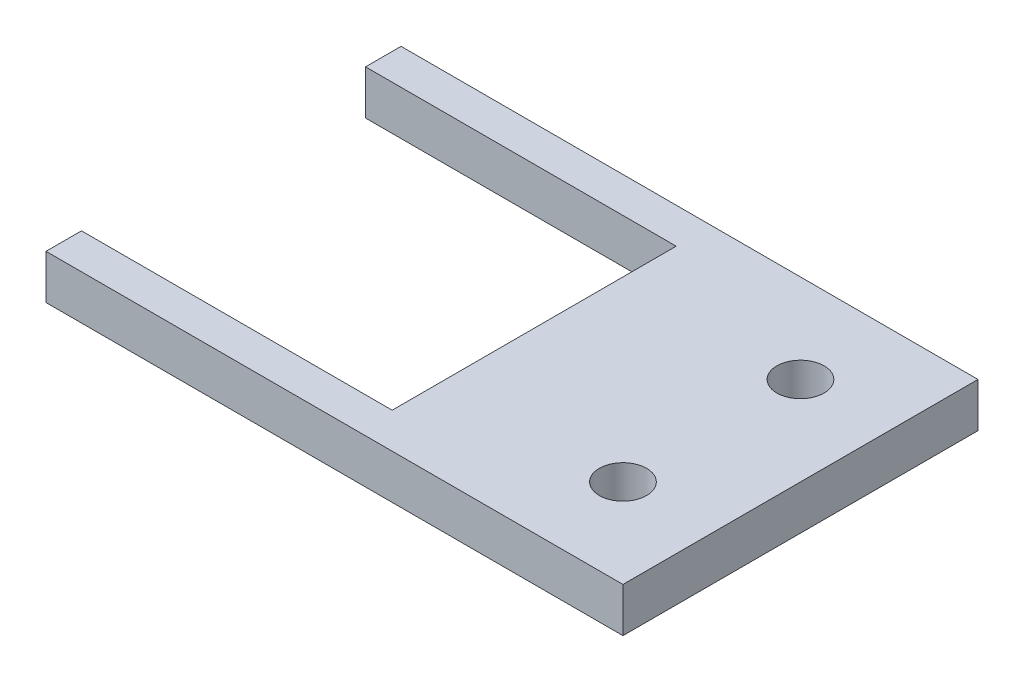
from build123d import *

# Parameters (mm, degrees)
SKETCH1_W                = 76.2
SKETCH1_H                = 50.8
BOSS_EXTRUDE1_DEPTH      = 6.35
SKETCH2_W                = 44.45
SKETCH2_H                = 35.56
CUT_EXTRUDE1_DEPTH       = 6.35
SKETCH5_W                = 44.45
SKETCH5_H                = 2.54
CUT_EXTRUDE3_DEPTH       = 55.417029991
CUT_EXTRUDE5_DEPTH       = 55.417029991
CUT_EXTRUDE5_DEPTH_BACK  = 55.417029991
SKETCH6_W                = 44.45
SKETCH6_H                = 2.54
SKETCH7_W                = 50.8
SKETCH7_H                = 6.35
BOSS_EXTRUDE2_DEPTH      = 6.35
H_0_266_DIAMETER_HOLE1_D = 6.7564


with BuildPart() as part:
    # Sketch1 → Boss-Extrude1 (new body)
    with BuildSketch(Plane(origin=(0, 0, 0), x_dir=(1, 0, 0), z_dir=(0, 1, 0))):
        with Locations((-5.571345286, -6.438722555)):
            Rectangle(SKETCH1_W, SKETCH1_H)
    extrude(amount=-BOSS_EXTRUDE1_DEPTH)

    # Sketch2 → Cut-Extrude1 (cut)
    with BuildSketch(Plane(origin=(0, 0, 0), x_dir=(1, 0, 0), z_dir=(0, 1, 0))):
        with Locations((-21.446345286, -6.438722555)):
            Rectangle(SKETCH2_W, SKETCH2_H)
    extrude(amount=-CUT_EXTRUDE1_DEPTH, mode=Mode.SUBTRACT)

    # Sketch5 → Cut-Extrude3 (cut, through all)
    with BuildSketch(Plane(origin=(0, 0, 0), x_dir=(1, 0, 0), z_dir=(0, 1, 0))):
        with Locations((-21.446345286, 12.611277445)):
            Rectangle(SKETCH5_W, SKETCH5_H)
    extrude(amount=-CUT_EXTRUDE3_DEPTH, mode=Mode.SUBTRACT)

    # Sketch6 → Cut-Extrude5 (cut, two sides: drawn at the far end of the back side and taken through both)
    with BuildSketch(Plane(origin=(0, 0, 0), x_dir=(1, 0, 0), z_dir=(0, 1, 0)).offset(-CUT_EXTRUDE5_DEPTH_BACK)):
        with Locations((-21.446345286, -25.488722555)):
            Rectangle(SKETCH6_W, SKETCH6_H)
    extrude(amount=CUT_EXTRUDE5_DEPTH + CUT_EXTRUDE5_DEPTH_BACK, mode=Mode.SUBTRACT)

    # Sketch7 → Boss-Extrude2 (add)
    with BuildSketch(Plane(origin=(32.528654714, 0, 0), x_dir=(0, 0, -1), z_dir=(1, 0, 0))):
        with Locations((-6.438722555, -3.175)):
            Rectangle(SKETCH7_W, SKETCH7_H)
    extrude(amount=BOSS_EXTRUDE2_DEPTH)

    # H _0.266_ Diameter Hole1 (through all)
    with Locations(Plane(origin=(0, 0, 0), x_dir=(1, 0, 0), z_dir=(0, 1, 0))):
        with Locations((26.178654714, 6.261277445), (26.178654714, -19.138722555)):
            Hole(H_0_266_DIAMETER_HOLE1_D / 2)


solid = part.part
